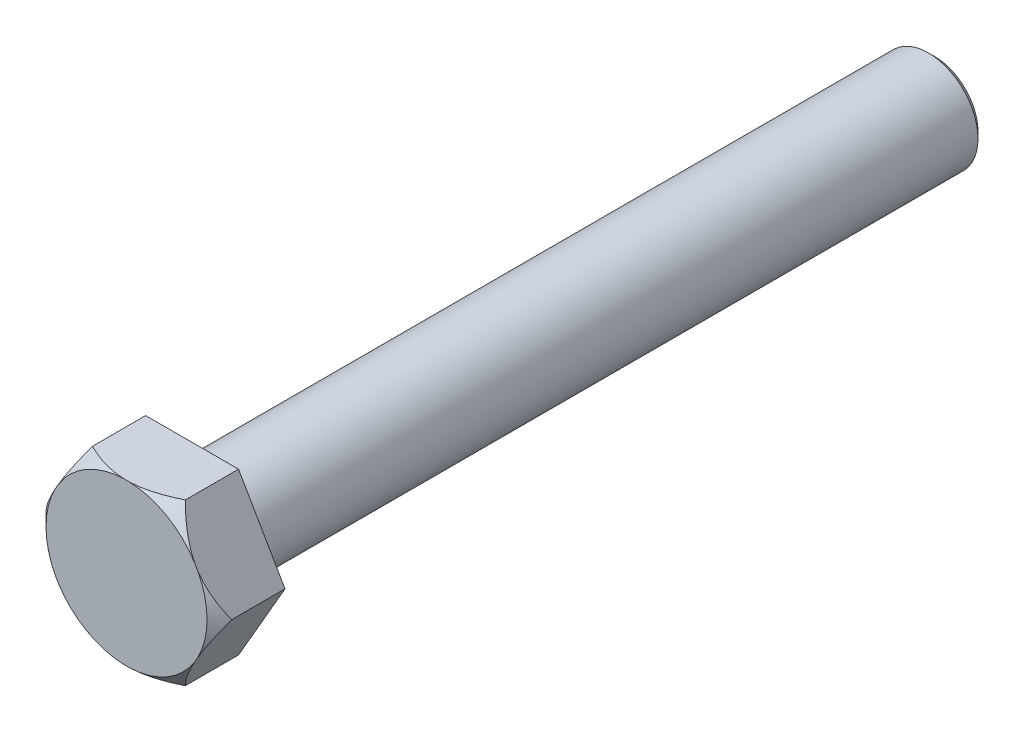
ISO-10303-21;
HEADER;
FILE_DESCRIPTION(('STEP AP214'),'2;1');
FILE_NAME('part.step','',(''),(''),'','','');
FILE_SCHEMA(('AUTOMOTIVE_DESIGN { 1 0 10303 214 1 1 1 1 }'));
ENDSEC;
DATA;
#1=APPLICATION_CONTEXT('core data for automotive mechanical design processes');
#2=APPLICATION_PROTOCOL_DEFINITION('international standard','automotive_design',2000,#1);
#3=PRODUCT_CONTEXT('',#1,'mechanical');
#4=PRODUCT('Part','Part','',(#3));
#5=PRODUCT_RELATED_PRODUCT_CATEGORY('part','',(#4));
#6=PRODUCT_DEFINITION_FORMATION('','',#4);
#7=PRODUCT_DEFINITION_CONTEXT('part definition',#1,'design');
#8=PRODUCT_DEFINITION('design','',#6,#7);
#9=PRODUCT_DEFINITION_SHAPE('','',#8);
#10=(LENGTH_UNIT() NAMED_UNIT(*) SI_UNIT(.MILLI.,.METRE.));
#11=(NAMED_UNIT(*) PLANE_ANGLE_UNIT() SI_UNIT($,.RADIAN.));
#12=(NAMED_UNIT(*) SI_UNIT($,.STERADIAN.) SOLID_ANGLE_UNIT());
#13=UNCERTAINTY_MEASURE_WITH_UNIT(LENGTH_MEASURE(1.E-05),#10,'distance_accuracy_value','');
#14=(GEOMETRIC_REPRESENTATION_CONTEXT(3) GLOBAL_UNCERTAINTY_ASSIGNED_CONTEXT((#13)) GLOBAL_UNIT_ASSIGNED_CONTEXT((#10,
#11,#12)) REPRESENTATION_CONTEXT('',''));
#15=CARTESIAN_POINT('',(0.,0.,0.));
#16=DIRECTION('',(0.,0.,1.));
#17=DIRECTION('',(1.,0.,0.));
#18=AXIS2_PLACEMENT_3D('',#15,#16,#17);
#19=CARTESIAN_POINT('',(0.,-4.,0.));
#20=DIRECTION('',(0.,0.,1.));
#21=DIRECTION('',(1.,0.,0.));
#22=AXIS2_PLACEMENT_3D('',#19,#20,#21);
#23=PLANE('',#22);
#24=CARTESIAN_POINT('',(0.,0.,0.));
#25=DIRECTION('',(0.,0.,1.));
#26=DIRECTION('',(1.,0.,0.));
#27=AXIS2_PLACEMENT_3D('',#24,#25,#26);
#28=CIRCLE('',#27,4.);
#29=CARTESIAN_POINT('',(4.,0.,0.));
#30=VERTEX_POINT('',#29);
#31=EDGE_CURVE('E11',#30,#30,#28,.T.);
#32=ORIENTED_EDGE('',*,*,#31,.T.);
#33=EDGE_LOOP('',(#32));
#34=FACE_BOUND('',#33,.T.);
#35=ADVANCED_FACE('F38',(#34),#23,.T.);
#36=CARTESIAN_POINT('',(0.,0.,0.));
#37=DIRECTION('',(0.,0.,1.));
#38=DIRECTION('',(1.,0.,0.));
#39=AXIS2_PLACEMENT_3D('',#36,#37,#38);
#40=CYLINDRICAL_SURFACE('',#39,4.);
#41=CARTESIAN_POINT('',(0.,0.,-59.5));
#42=DIRECTION('',(0.,0.,1.));
#43=DIRECTION('',(1.,0.,0.));
#44=AXIS2_PLACEMENT_3D('',#41,#42,#43);
#45=CIRCLE('',#44,4.);
#46=CARTESIAN_POINT('',(4.,0.,-59.5));
#47=VERTEX_POINT('',#46);
#48=EDGE_CURVE('E44',#47,#47,#45,.T.);
#49=ORIENTED_EDGE('',*,*,#48,.T.);
#50=EDGE_LOOP('',(#49));
#51=FACE_BOUND('',#50,.T.);
#52=ORIENTED_EDGE('',*,*,#31,.F.);
#53=EDGE_LOOP('',(#52));
#54=FACE_BOUND('',#53,.T.);
#55=ADVANCED_FACE('F64',(#51,#54),#40,.T.);
#56=CARTESIAN_POINT('',(0.,0.,-59.5));
#57=DIRECTION('',(0.,0.,1.));
#58=DIRECTION('',(1.,0.,0.));
#59=AXIS2_PLACEMENT_3D('',#56,#57,#58);
#60=CONICAL_SURFACE('',#59,4.,0.785398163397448);
#61=CARTESIAN_POINT('',(0.,0.,-60.));
#62=DIRECTION('',(0.,0.,1.));
#63=DIRECTION('',(1.,0.,0.));
#64=AXIS2_PLACEMENT_3D('',#61,#62,#63);
#65=CIRCLE('',#64,3.5);
#66=CARTESIAN_POINT('',(3.5,0.,-60.));
#67=VERTEX_POINT('',#66);
#68=EDGE_CURVE('E48',#67,#67,#65,.T.);
#69=ORIENTED_EDGE('',*,*,#68,.T.);
#70=EDGE_LOOP('',(#69));
#71=FACE_BOUND('',#70,.T.);
#72=ORIENTED_EDGE('',*,*,#48,.F.);
#73=EDGE_LOOP('',(#72));
#74=FACE_BOUND('',#73,.T.);
#75=ADVANCED_FACE('F55',(#71,#74),#60,.T.);
#76=CARTESIAN_POINT('',(0.,-3.5,-60.));
#77=DIRECTION('',(0.,0.,-1.));
#78=DIRECTION('',(-1.,0.,0.));
#79=AXIS2_PLACEMENT_3D('',#76,#77,#78);
#80=PLANE('',#79);
#81=ORIENTED_EDGE('',*,*,#68,.F.);
#82=EDGE_LOOP('',(#81));
#83=FACE_BOUND('',#82,.T.);
#84=ADVANCED_FACE('F58',(#83),#80,.T.);
#85=CLOSED_SHELL('',(#35,#55,#75,#84));
#86=MANIFOLD_SOLID_BREP('B2',#85);
#87=CARTESIAN_POINT('',(3.75277674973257,-6.5,5.3));
#88=DIRECTION('',(-0.866025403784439,0.5,0.));
#89=DIRECTION('',(-0.5,-0.866025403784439,0.));
#90=AXIS2_PLACEMENT_3D('',#87,#88,#89);
#91=PLANE('',#90);
#92=DIRECTION('',(0.,0.,-1.));
#93=VECTOR('',#92,1.);
#94=CARTESIAN_POINT('',(7.50555349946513,0.,5.3));
#95=LINE('',#94,#93);
#96=CARTESIAN_POINT('',(7.50555349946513,0.,4.3));
#97=VERTEX_POINT('',#96);
#98=CARTESIAN_POINT('',(7.50555349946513,0.,0.));
#99=VERTEX_POINT('',#98);
#100=EDGE_CURVE('E240',#97,#99,#95,.T.);
#101=ORIENTED_EDGE('',*,*,#100,.F.);
#102=CARTESIAN_POINT('',(10.1286443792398,4.54332667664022,0.704596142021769));
#103=CARTESIAN_POINT('',(10.039761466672,4.38937695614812,0.848684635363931));
#104=CARTESIAN_POINT('',(9.95052655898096,4.23481756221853,0.991912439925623));
#105=CARTESIAN_POINT('',(9.77123095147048,3.92426846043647,1.27631743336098));
#106=CARTESIAN_POINT('',(9.68117017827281,3.76827862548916,1.41749443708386));
#107=CARTESIAN_POINT('',(9.49990390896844,3.45431623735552,1.69777201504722));
#108=CARTESIAN_POINT('',(9.40869621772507,3.29633988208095,1.83686692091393));
#109=CARTESIAN_POINT('',(9.2252068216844,2.97852692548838,2.11218789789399));
#110=CARTESIAN_POINT('',(9.13292514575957,2.81869037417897,2.24841404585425));
#111=CARTESIAN_POINT('',(8.94456358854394,2.49243858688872,2.52115169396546));
#112=CARTESIAN_POINT('',(8.84844908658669,2.32596338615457,2.65756778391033));
#113=CARTESIAN_POINT('',(8.65470525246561,1.99038922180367,2.92602381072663));
#114=CARTESIAN_POINT('',(8.5570759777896,1.82129035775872,3.0580639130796));
#115=CARTESIAN_POINT('',(8.36013893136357,1.48018538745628,3.31668899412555));
#116=CARTESIAN_POINT('',(8.26083264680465,1.30818185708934,3.44327848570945));
#117=CARTESIAN_POINT('',(8.0601982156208,0.960672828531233,3.68985078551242));
#118=CARTESIAN_POINT('',(7.95887032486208,0.78516777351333,3.80983442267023));
#119=CARTESIAN_POINT('',(7.75111491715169,0.425324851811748,4.04472132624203));
#120=CARTESIAN_POINT('',(7.64462356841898,0.24087642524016,4.15940026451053));
#121=CARTESIAN_POINT('',(7.42883796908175,-0.132875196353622,4.37785828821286));
#122=CARTESIAN_POINT('',(7.31954332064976,-0.3221790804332,4.48163581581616));
#123=CARTESIAN_POINT('',(7.09850568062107,-0.705027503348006,4.67487713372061));
#124=CARTESIAN_POINT('',(6.98677906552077,-0.898543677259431,4.7644150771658));
#125=CARTESIAN_POINT('',(6.76025349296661,-1.29089747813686,4.92639894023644));
#126=CARTESIAN_POINT('',(6.64545547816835,-1.48973347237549,4.99885003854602));
#127=CARTESIAN_POINT('',(6.43587432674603,-1.85273867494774,5.11072478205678));
#128=CARTESIAN_POINT('',(6.34158660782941,-2.01604979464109,5.15384004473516));
#129=CARTESIAN_POINT('',(6.15157362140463,-2.34516194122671,5.22476075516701));
#130=CARTESIAN_POINT('',(6.0558485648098,-2.51096260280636,5.25256842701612));
#131=CARTESIAN_POINT('',(5.8637126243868,-2.84375181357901,5.29144611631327));
#132=CARTESIAN_POINT('',(5.76730326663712,-3.01073771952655,5.30254587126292));
#133=CARTESIAN_POINT('',(5.5743709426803,-3.34490630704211,5.30749252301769));
#134=CARTESIAN_POINT('',(5.47784797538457,-3.51208899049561,5.30133925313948));
#135=CARTESIAN_POINT('',(5.28569658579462,-3.84490496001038,5.27215863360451));
#136=CARTESIAN_POINT('',(5.19006652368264,-4.01054108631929,5.24917378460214));
#137=CARTESIAN_POINT('',(5.00008490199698,-4.33959890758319,5.18756324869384));
#138=CARTESIAN_POINT('',(4.90573344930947,-4.50302041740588,5.14893626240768));
#139=CARTESIAN_POINT('',(4.71846263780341,-4.82738297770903,5.05763503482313));
#140=CARTESIAN_POINT('',(4.6255484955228,-4.98831499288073,5.00491850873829));
#141=CARTESIAN_POINT('',(4.44167070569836,-5.30680066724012,4.88744691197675));
#142=CARTESIAN_POINT('',(4.35070696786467,-5.46435448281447,4.82269239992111));
#143=CARTESIAN_POINT('',(4.13900239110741,-5.83103756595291,4.65838995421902));
#144=CARTESIAN_POINT('',(4.01908237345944,-6.03874512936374,4.55462806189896));
#145=CARTESIAN_POINT('',(3.78262258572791,-6.4483054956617,4.33258564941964));
#146=CARTESIAN_POINT('',(3.66608473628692,-6.65015497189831,4.21429707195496));
#147=CARTESIAN_POINT('',(3.43582542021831,-7.0489758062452,3.96621331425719));
#148=CARTESIAN_POINT('',(3.3221102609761,-7.2459362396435,3.83639489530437));
#149=CARTESIAN_POINT('',(3.09735084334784,-7.63523097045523,3.56796602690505));
#150=CARTESIAN_POINT('',(2.98630610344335,-7.82756610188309,3.4293571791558));
#151=CARTESIAN_POINT('',(2.76596059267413,-8.20921572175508,3.14452754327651));
#152=CARTESIAN_POINT('',(2.65667036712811,-8.39851194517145,2.99827427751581));
#153=CARTESIAN_POINT('',(2.44001623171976,-8.77376791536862,2.70017211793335));
#154=CARTESIAN_POINT('',(2.33265239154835,-8.95972754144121,2.54832302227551));
#155=CARTESIAN_POINT('',(2.11967159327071,-9.32862110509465,2.24027391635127));
#156=CARTESIAN_POINT('',(2.01405293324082,-9.51155799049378,2.08407859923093));
#157=CARTESIAN_POINT('',(1.80420589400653,-9.87502372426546,1.76801397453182));
#158=CARTESIAN_POINT('',(1.69997748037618,-10.0555526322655,1.60814475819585));
#159=CARTESIAN_POINT('',(1.51776278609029,-10.3711577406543,1.32438976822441));
#160=CARTESIAN_POINT('',(1.43952456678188,-10.5066703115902,1.20114938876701));
#161=CARTESIAN_POINT('',(1.28399947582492,-10.7760476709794,0.953684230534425));
#162=CARTESIAN_POINT('',(1.20670993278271,-10.9099170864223,0.829466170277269));
#163=CARTESIAN_POINT('',(1.12968586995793,-11.0433266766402,0.704596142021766));
#164=B_SPLINE_CURVE_WITH_KNOTS('',3,(#102,#103,#104,#105,#106,#107,#108,#109,#110,#111,#112,
#113,#114,#115,#116,#117,#118,#119,#120,#121,#122,#123,#124,#125,#126,#127,#128,#129,#130,#131,
#132,#133,#134,#135,#136,#137,#138,#139,#140,#141,#142,#143,#144,#145,#146,#147,#148,#149,#150,
#151,#152,#153,#154,#155,#156,#157,#158,#159,#160,#161,#162,#163),.UNSPECIFIED.,.F.,.F.,(4,2,2,
2,2,2,2,2,2,2,2,2,2,2,2,2,2,2,2,2,2,2,2,2,2,2,2,2,2,2,4),(0.,0.686488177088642,1.3730379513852,
2.06120340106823,2.749350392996,3.4564439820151,4.16351080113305,4.8699804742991,
5.57636129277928,6.30179544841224,7.02733312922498,7.74895922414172,8.47036632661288,
9.05013970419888,9.62982882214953,10.2084849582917,10.7871466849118,11.3643522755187,
11.941605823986,12.52061163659,13.0995905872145,13.8829026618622,14.6666511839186,
15.4520168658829,16.2372398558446,17.0261239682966,17.8150365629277,18.6031280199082,
19.3911999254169,19.9887336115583,20.5836377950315),.UNSPECIFIED.);
#165=CARTESIAN_POINT('',(5.76353991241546,-3.01725604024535,5.3));
#166=VERTEX_POINT('',#165);
#167=EDGE_CURVE('E218',#97,#166,#164,.T.);
#168=ORIENTED_EDGE('',*,*,#167,.T.);
#169=DIRECTION('',(0.5,0.866025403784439,0.));
#170=VECTOR('',#169,1.);
#171=CARTESIAN_POINT('',(3.75277674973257,-6.5,5.3));
#172=LINE('',#171,#170);
#173=CARTESIAN_POINT('',(5.49479033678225,-3.48274395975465,5.3));
#174=VERTEX_POINT('',#173);
#175=EDGE_CURVE('E232',#174,#166,#172,.T.);
#176=ORIENTED_EDGE('',*,*,#175,.F.);
#177=CARTESIAN_POINT('',(3.75277674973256,-6.5,4.3));
#178=VERTEX_POINT('',#177);
#179=EDGE_CURVE('E305',#174,#178,#164,.T.);
#180=ORIENTED_EDGE('',*,*,#179,.T.);
#181=DIRECTION('',(0.,0.,-1.));
#182=VECTOR('',#181,1.);
#183=CARTESIAN_POINT('',(3.75277674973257,-6.5,5.3));
#184=LINE('',#183,#182);
#185=CARTESIAN_POINT('',(3.75277674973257,-6.5,0.));
#186=VERTEX_POINT('',#185);
#187=EDGE_CURVE('E213',#178,#186,#184,.T.);
#188=ORIENTED_EDGE('',*,*,#187,.T.);
#189=DIRECTION('',(0.5,0.866025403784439,0.));
#190=VECTOR('',#189,1.);
#191=CARTESIAN_POINT('',(3.75277674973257,-6.5,0.));
#192=LINE('',#191,#190);
#193=EDGE_CURVE('E214',#186,#99,#192,.T.);
#194=ORIENTED_EDGE('',*,*,#193,.T.);
#195=EDGE_LOOP('',(#101,#168,#176,#180,#188,#194));
#196=FACE_BOUND('',#195,.T.);
#197=ADVANCED_FACE('F93',(#196),#91,.F.);
#198=CARTESIAN_POINT('',(7.50555349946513,0.,5.3));
#199=DIRECTION('',(-0.866025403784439,-0.5,0.));
#200=DIRECTION('',(0.5,-0.866025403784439,0.));
#201=AXIS2_PLACEMENT_3D('',#198,#199,#200);
#202=PLANE('',#201);
#203=DIRECTION('',(0.,0.,-1.));
#204=VECTOR('',#203,1.);
#205=CARTESIAN_POINT('',(3.75277674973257,6.5,5.3));
#206=LINE('',#205,#204);
#207=CARTESIAN_POINT('',(3.75277674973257,6.5,4.3));
#208=VERTEX_POINT('',#207);
#209=CARTESIAN_POINT('',(3.75277674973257,6.5,0.));
#210=VERTEX_POINT('',#209);
#211=EDGE_CURVE('E239',#208,#210,#206,.T.);
#212=ORIENTED_EDGE('',*,*,#211,.F.);
#213=CARTESIAN_POINT('',(1.12968586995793,11.0433266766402,0.704596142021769));
#214=CARTESIAN_POINT('',(1.21856878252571,10.8893769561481,0.848684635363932));
#215=CARTESIAN_POINT('',(1.30780369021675,10.7348175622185,0.991912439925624));
#216=CARTESIAN_POINT('',(1.48709929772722,10.4242684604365,1.27631743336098));
#217=CARTESIAN_POINT('',(1.57716007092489,10.2682786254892,1.41749443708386));
#218=CARTESIAN_POINT('',(1.75842634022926,9.95431623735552,1.69777201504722));
#219=CARTESIAN_POINT('',(1.84963403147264,9.79633988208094,1.83686692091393));
#220=CARTESIAN_POINT('',(2.0331234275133,9.47852692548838,2.11218789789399));
#221=CARTESIAN_POINT('',(2.12540510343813,9.31869037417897,2.24841404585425));
#222=CARTESIAN_POINT('',(2.31376666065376,8.99243858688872,2.52115169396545));
#223=CARTESIAN_POINT('',(2.40988116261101,8.82596338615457,2.65756778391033));
#224=CARTESIAN_POINT('',(2.60362499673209,8.49038922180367,2.92602381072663));
#225=CARTESIAN_POINT('',(2.7012542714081,8.32129035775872,3.05806391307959));
#226=CARTESIAN_POINT('',(2.89819131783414,7.98018538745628,3.31668899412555));
#227=CARTESIAN_POINT('',(2.99749760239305,7.80818185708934,3.44327848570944));
#228=CARTESIAN_POINT('',(3.1981320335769,7.46067282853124,3.68985078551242));
#229=CARTESIAN_POINT('',(3.29945992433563,7.28516777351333,3.80983442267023));
#230=CARTESIAN_POINT('',(3.50721533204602,6.92532485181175,4.04472132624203));
#231=CARTESIAN_POINT('',(3.61370668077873,6.74087642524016,4.15940026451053));
#232=CARTESIAN_POINT('',(3.82949228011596,6.36712480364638,4.37785828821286));
#233=CARTESIAN_POINT('',(3.93878692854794,6.1778209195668,4.48163581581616));
#234=CARTESIAN_POINT('',(4.15982456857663,5.794972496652,4.67487713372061));
#235=CARTESIAN_POINT('',(4.27155118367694,5.60145632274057,4.7644150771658));
#236=CARTESIAN_POINT('',(4.49807675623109,5.20910252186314,4.92639894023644));
#237=CARTESIAN_POINT('',(4.61287477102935,5.01026652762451,4.99885003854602));
#238=CARTESIAN_POINT('',(4.82245592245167,4.64726132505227,5.11072478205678));
#239=CARTESIAN_POINT('',(4.91674364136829,4.48395020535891,5.15384004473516));
#240=CARTESIAN_POINT('',(5.10675662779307,4.15483805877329,5.22476075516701));
#241=CARTESIAN_POINT('',(5.20248168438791,3.98903739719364,5.25256842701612));
#242=CARTESIAN_POINT('',(5.3946176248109,3.65624818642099,5.29144611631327));
#243=CARTESIAN_POINT('',(5.49102698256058,3.48926228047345,5.30254587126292));
#244=CARTESIAN_POINT('',(5.6839593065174,3.15509369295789,5.30749252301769));
#245=CARTESIAN_POINT('',(5.78048227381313,2.98791100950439,5.30133925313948));
#246=CARTESIAN_POINT('',(5.97263366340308,2.65509503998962,5.27215863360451));
#247=CARTESIAN_POINT('',(6.06826372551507,2.48945891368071,5.24917378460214));
#248=CARTESIAN_POINT('',(6.25824534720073,2.16040109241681,5.18756324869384));
#249=CARTESIAN_POINT('',(6.35259679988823,1.99697958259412,5.14893626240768));
#250=CARTESIAN_POINT('',(6.5398676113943,1.67261702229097,5.05763503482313));
#251=CARTESIAN_POINT('',(6.6327817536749,1.51168500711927,5.00491850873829));
#252=CARTESIAN_POINT('',(6.81665954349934,1.19319933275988,4.88744691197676));
#253=CARTESIAN_POINT('',(6.90762328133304,1.03564551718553,4.82269239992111));
#254=CARTESIAN_POINT('',(7.1193278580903,0.668962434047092,4.65838995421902));
#255=CARTESIAN_POINT('',(7.23924787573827,0.461254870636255,4.55462806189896));
#256=CARTESIAN_POINT('',(7.4757076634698,0.0516945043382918,4.33258564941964));
#257=CARTESIAN_POINT('',(7.59224551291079,-0.150154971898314,4.21429707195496));
#258=CARTESIAN_POINT('',(7.82250482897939,-0.548975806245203,3.96621331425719));
#259=CARTESIAN_POINT('',(7.93621998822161,-0.7459362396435,3.83639489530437));
#260=CARTESIAN_POINT('',(8.16097940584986,-1.13523097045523,3.56796602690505));
#261=CARTESIAN_POINT('',(8.27202414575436,-1.32756610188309,3.4293571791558));
#262=CARTESIAN_POINT('',(8.49236965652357,-1.70921572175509,3.14452754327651));
#263=CARTESIAN_POINT('',(8.6016598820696,-1.89851194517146,2.99827427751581));
#264=CARTESIAN_POINT('',(8.81831401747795,-2.27376791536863,2.70017211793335));
#265=CARTESIAN_POINT('',(8.92567785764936,-2.45972754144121,2.5483230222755));
#266=CARTESIAN_POINT('',(9.138658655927,-2.82862110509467,2.24027391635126));
#267=CARTESIAN_POINT('',(9.24427731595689,-3.01155799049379,2.08407859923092));
#268=CARTESIAN_POINT('',(9.45412435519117,-3.37502372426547,1.76801397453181));
#269=CARTESIAN_POINT('',(9.55835276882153,-3.55555263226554,1.60814475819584));
#270=CARTESIAN_POINT('',(9.74056746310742,-3.87115774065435,1.3243897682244));
#271=CARTESIAN_POINT('',(9.81880568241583,-4.00667031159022,1.20114938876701));
#272=CARTESIAN_POINT('',(9.97433077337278,-4.27604767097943,0.953684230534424));
#273=CARTESIAN_POINT('',(10.051620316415,-4.40991708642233,0.829466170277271));
#274=CARTESIAN_POINT('',(10.1286443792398,-4.54332667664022,0.704596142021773));
#275=B_SPLINE_CURVE_WITH_KNOTS('',3,(#213,#214,#215,#216,#217,#218,#219,#220,#221,#222,#223,
#224,#225,#226,#227,#228,#229,#230,#231,#232,#233,#234,#235,#236,#237,#238,#239,#240,#241,#242,
#243,#244,#245,#246,#247,#248,#249,#250,#251,#252,#253,#254,#255,#256,#257,#258,#259,#260,#261,
#262,#263,#264,#265,#266,#267,#268,#269,#270,#271,#272,#273,#274),.UNSPECIFIED.,.F.,.F.,(4,2,2,
2,2,2,2,2,2,2,2,2,2,2,2,2,2,2,2,2,2,2,2,2,2,2,2,2,2,2,4),(0.,0.686488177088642,1.37303795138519,
2.06120340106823,2.749350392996,3.4564439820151,4.16351080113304,4.86998047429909,
5.57636129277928,6.30179544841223,7.02733312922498,7.74895922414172,8.47036632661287,
9.05013970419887,9.62982882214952,10.2084849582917,10.7871466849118,11.3643522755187,
11.941605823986,12.52061163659,13.0995905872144,13.8829026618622,14.6666511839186,
15.4520168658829,16.2372398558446,17.0261239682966,17.8150365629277,18.6031280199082,
19.391199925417,19.9887336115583,20.5836377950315),.UNSPECIFIED.);
#276=CARTESIAN_POINT('',(5.49479033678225,3.48274395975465,5.3));
#277=VERTEX_POINT('',#276);
#278=EDGE_CURVE('E268',#208,#277,#275,.T.);
#279=ORIENTED_EDGE('',*,*,#278,.T.);
#280=DIRECTION('',(-0.5,0.866025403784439,0.));
#281=VECTOR('',#280,1.);
#282=CARTESIAN_POINT('',(7.50555349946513,0.,5.3));
#283=LINE('',#282,#281);
#284=CARTESIAN_POINT('',(5.76353991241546,3.01725604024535,5.3));
#285=VERTEX_POINT('',#284);
#286=EDGE_CURVE('E207',#285,#277,#283,.T.);
#287=ORIENTED_EDGE('',*,*,#286,.F.);
#288=EDGE_CURVE('E273',#285,#97,#275,.T.);
#289=ORIENTED_EDGE('',*,*,#288,.T.);
#290=ORIENTED_EDGE('',*,*,#100,.T.);
#291=DIRECTION('',(-0.5,0.866025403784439,0.));
#292=VECTOR('',#291,1.);
#293=CARTESIAN_POINT('',(7.50555349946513,0.,0.));
#294=LINE('',#293,#292);
#295=EDGE_CURVE('E217',#99,#210,#294,.T.);
#296=ORIENTED_EDGE('',*,*,#295,.T.);
#297=EDGE_LOOP('',(#212,#279,#287,#289,#290,#296));
#298=FACE_BOUND('',#297,.T.);
#299=ADVANCED_FACE('F278',(#298),#202,.F.);
#300=CARTESIAN_POINT('',(3.75277674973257,6.5,5.3));
#301=DIRECTION('',(0.,-1.,0.));
#302=DIRECTION('',(1.,0.,0.));
#303=AXIS2_PLACEMENT_3D('',#300,#301,#302);
#304=PLANE('',#303);
#305=DIRECTION('',(0.,0.,-1.));
#306=VECTOR('',#305,1.);
#307=CARTESIAN_POINT('',(-3.75277674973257,6.5,5.3));
#308=LINE('',#307,#306);
#309=CARTESIAN_POINT('',(-3.75277674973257,6.5,4.3));
#310=VERTEX_POINT('',#309);
#311=CARTESIAN_POINT('',(-3.75277674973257,6.5,0.));
#312=VERTEX_POINT('',#311);
#313=EDGE_CURVE('E237',#310,#312,#308,.T.);
#314=ORIENTED_EDGE('',*,*,#313,.F.);
#315=CARTESIAN_POINT('',(-8.29610342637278,6.5,1.26632525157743));
#316=CARTESIAN_POINT('',(-8.11036530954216,6.5,1.41250581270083));
#317=CARTESIAN_POINT('',(-7.92373684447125,6.5,1.55756954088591));
#318=CARTESIAN_POINT('',(-7.54835509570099,6.5,1.84498409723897));
#319=CARTESIAN_POINT('',(-7.35960146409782,6.5,1.98733447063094));
#320=CARTESIAN_POINT('',(-6.97873252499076,6.5,2.2695011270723));
#321=CARTESIAN_POINT('',(-6.7866050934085,6.5,2.40930108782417));
#322=CARTESIAN_POINT('',(-6.39953728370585,6.5,2.68493925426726));
#323=CARTESIAN_POINT('',(-6.20459704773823,6.5,2.82077765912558));
#324=CARTESIAN_POINT('',(-5.80175036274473,6.5,3.09421885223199));
#325=CARTESIAN_POINT('',(-5.59367836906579,6.5,3.231578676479));
#326=CARTESIAN_POINT('',(-5.17329124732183,6.5,3.49972871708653));
#327=CARTESIAN_POINT('',(-4.96097565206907,6.5,3.63051820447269));
#328=CARTESIAN_POINT('',(-4.53185755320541,6.5,3.88357409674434));
#329=CARTESIAN_POINT('',(-4.31506466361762,6.5,4.00585671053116));
#330=CARTESIAN_POINT('',(-3.87593140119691,6.5,4.23995118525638));
#331=CARTESIAN_POINT('',(-3.65359273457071,6.5,4.35176621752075));
#332=CARTESIAN_POINT('',(-3.22593082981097,6.5,4.55126761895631));
#333=CARTESIAN_POINT('',(-3.02121813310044,6.5,4.64025315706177));
#334=CARTESIAN_POINT('',(-2.60646306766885,6.5,4.80502186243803));
#335=CARTESIAN_POINT('',(-2.39642019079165,6.5,4.88080376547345));
#336=CARTESIAN_POINT('',(-1.97356357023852,6.5,5.01546630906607));
#337=CARTESIAN_POINT('',(-1.76080909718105,6.5,5.07453054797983));
#338=CARTESIAN_POINT('',(-1.33093571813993,6.5,5.17398366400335));
#339=CARTESIAN_POINT('',(-1.11381737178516,6.5,5.21437492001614));
#340=CARTESIAN_POINT('',(-0.672554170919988,6.5,5.27457108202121));
#341=CARTESIAN_POINT('',(-0.448353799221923,6.5,5.29397782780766));
#342=CARTESIAN_POINT('',(0.000845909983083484,6.5,5.30942901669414));
#343=CARTESIAN_POINT('',(0.225845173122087,6.5,5.30547558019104));
#344=CARTESIAN_POINT('',(0.67488777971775,6.5,5.27446419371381));
#345=CARTESIAN_POINT('',(0.898926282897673,6.5,5.24733749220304));
#346=CARTESIAN_POINT('',(1.34336613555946,6.5,5.17180698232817));
#347=CARTESIAN_POINT('',(1.56376649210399,6.5,5.12339746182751));
#348=CARTESIAN_POINT('',(2.06628953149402,6.5,4.99055568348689));
#349=CARTESIAN_POINT('',(2.34668289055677,6.5,4.89963518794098));
#350=CARTESIAN_POINT('',(2.89824997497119,6.5,4.69329359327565));
#351=CARTESIAN_POINT('',(3.16941809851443,6.5,4.57785790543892));
#352=CARTESIAN_POINT('',(3.70495151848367,6.5,4.32757146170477));
#353=CARTESIAN_POINT('',(3.96925216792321,6.5,4.19258424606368));
#354=CARTESIAN_POINT('',(4.49001736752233,6.5,3.90855044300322));
#355=CARTESIAN_POINT('',(4.74648371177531,6.5,3.75950710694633));
#356=CARTESIAN_POINT('',(5.2907154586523,6.5,3.42770091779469));
#357=CARTESIAN_POINT('',(5.57743102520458,6.5,3.24322742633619));
#358=CARTESIAN_POINT('',(6.14392762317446,6.5,2.86387292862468));
#359=CARTESIAN_POINT('',(6.42370706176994,6.5,2.66898956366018));
#360=CARTESIAN_POINT('',(6.97140928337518,6.5,2.27586119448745));
#361=CARTESIAN_POINT('',(7.23945723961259,6.5,2.07778986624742));
#362=CARTESIAN_POINT('',(7.63813759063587,6.5,1.77641508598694));
#363=CARTESIAN_POINT('',(7.77042024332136,6.5,1.67528153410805));
#364=CARTESIAN_POINT('',(8.0339850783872,6.5,1.47172940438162));
#365=CARTESIAN_POINT('',(8.16526730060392,6.5,1.36931087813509));
#366=CARTESIAN_POINT('',(8.29610342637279,6.5,1.26632525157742));
#367=B_SPLINE_CURVE_WITH_KNOTS('',3,(#315,#316,#317,#318,#319,#320,#321,#322,#323,#324,#325,
#326,#327,#328,#329,#330,#331,#332,#333,#334,#335,#336,#337,#338,#339,#340,#341,#342,#343,#344,
#345,#346,#347,#348,#349,#350,#351,#352,#353,#354,#355,#356,#357,#358,#359,#360,#361,#362,#363,
#364,#365,#366),.UNSPECIFIED.,.F.,.F.,(4,2,2,2,2,2,2,2,2,2,2,2,2,2,2,2,2,2,2,2,2,2,2,2,2,4),(0.,
0.709097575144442,1.41831297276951,2.13109111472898,2.84383335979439,3.59170118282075,
4.3396517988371,5.0861358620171,5.83239302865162,6.5016733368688,7.17101769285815,
7.83269743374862,8.49429285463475,9.16823229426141,9.84211056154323,10.5179950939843,
11.1940611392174,12.0768086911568,12.9600830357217,13.8498492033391,14.7394100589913,
15.7619006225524,16.7846238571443,17.7843881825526,18.2839221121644,18.7834360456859),.UNSPECIFIED.);
#368=CARTESIAN_POINT('',(-0.26874957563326,6.5,5.3));
#369=VERTEX_POINT('',#368);
#370=EDGE_CURVE('E255',#310,#369,#367,.T.);
#371=ORIENTED_EDGE('',*,*,#370,.T.);
#372=DIRECTION('',(-1.,0.,0.));
#373=VECTOR('',#372,1.);
#374=CARTESIAN_POINT('',(3.75277674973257,6.5,5.3));
#375=LINE('',#374,#373);
#376=CARTESIAN_POINT('',(0.268749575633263,6.5,5.3));
#377=VERTEX_POINT('',#376);
#378=EDGE_CURVE('E203',#377,#369,#375,.T.);
#379=ORIENTED_EDGE('',*,*,#378,.F.);
#380=EDGE_CURVE('E261',#377,#208,#367,.T.);
#381=ORIENTED_EDGE('',*,*,#380,.T.);
#382=ORIENTED_EDGE('',*,*,#211,.T.);
#383=DIRECTION('',(-1.,0.,0.));
#384=VECTOR('',#383,1.);
#385=CARTESIAN_POINT('',(3.75277674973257,6.5,0.));
#386=LINE('',#385,#384);
#387=EDGE_CURVE('E221',#210,#312,#386,.T.);
#388=ORIENTED_EDGE('',*,*,#387,.T.);
#389=EDGE_LOOP('',(#314,#371,#379,#381,#382,#388));
#390=FACE_BOUND('',#389,.T.);
#391=ADVANCED_FACE('F259',(#390),#304,.F.);
#392=CARTESIAN_POINT('',(-3.75277674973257,6.5,5.3));
#393=DIRECTION('',(0.866025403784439,-0.5,0.));
#394=DIRECTION('',(0.5,0.866025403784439,0.));
#395=AXIS2_PLACEMENT_3D('',#392,#393,#394);
#396=PLANE('',#395);
#397=DIRECTION('',(0.,0.,-1.));
#398=VECTOR('',#397,1.);
#399=CARTESIAN_POINT('',(-7.50555349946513,0.,5.3));
#400=LINE('',#399,#398);
#401=CARTESIAN_POINT('',(-7.50555349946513,0.,4.3));
#402=VERTEX_POINT('',#401);
#403=CARTESIAN_POINT('',(-7.50555349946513,0.,0.));
#404=VERTEX_POINT('',#403);
#405=EDGE_CURVE('E195',#402,#404,#400,.T.);
#406=ORIENTED_EDGE('',*,*,#405,.F.);
#407=CARTESIAN_POINT('',(-10.1286443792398,-4.54332667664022,0.704596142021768));
#408=CARTESIAN_POINT('',(-10.039761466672,-4.38937695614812,0.84868463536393));
#409=CARTESIAN_POINT('',(-9.95052655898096,-4.23481756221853,0.991912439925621));
#410=CARTESIAN_POINT('',(-9.77123095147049,-3.92426846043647,1.27631743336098));
#411=CARTESIAN_POINT('',(-9.68117017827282,-3.76827862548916,1.41749443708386));
#412=CARTESIAN_POINT('',(-9.49990390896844,-3.45431623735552,1.69777201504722));
#413=CARTESIAN_POINT('',(-9.40869621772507,-3.29633988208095,1.83686692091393));
#414=CARTESIAN_POINT('',(-9.2252068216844,-2.97852692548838,2.11218789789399));
#415=CARTESIAN_POINT('',(-9.13292514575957,-2.81869037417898,2.24841404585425));
#416=CARTESIAN_POINT('',(-8.94456358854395,-2.49243858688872,2.52115169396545));
#417=CARTESIAN_POINT('',(-8.84844908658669,-2.32596338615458,2.65756778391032));
#418=CARTESIAN_POINT('',(-8.65470525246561,-1.99038922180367,2.92602381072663));
#419=CARTESIAN_POINT('',(-8.55707597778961,-1.82129035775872,3.05806391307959));
#420=CARTESIAN_POINT('',(-8.36013893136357,-1.48018538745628,3.31668899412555));
#421=CARTESIAN_POINT('',(-8.26083264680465,-1.30818185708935,3.44327848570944));
#422=CARTESIAN_POINT('',(-8.0601982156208,-0.96067282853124,3.68985078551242));
#423=CARTESIAN_POINT('',(-7.95887032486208,-0.785167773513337,3.80983442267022));
#424=CARTESIAN_POINT('',(-7.75111491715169,-0.425324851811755,4.04472132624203));
#425=CARTESIAN_POINT('',(-7.64462356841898,-0.240876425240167,4.15940026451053));
#426=CARTESIAN_POINT('',(-7.42883796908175,0.132875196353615,4.37785828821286));
#427=CARTESIAN_POINT('',(-7.31954332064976,0.322179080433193,4.48163581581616));
#428=CARTESIAN_POINT('',(-7.09850568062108,0.705027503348,4.67487713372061));
#429=CARTESIAN_POINT('',(-6.98677906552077,0.898543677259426,4.7644150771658));
#430=CARTESIAN_POINT('',(-6.76025349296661,1.29089747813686,4.92639894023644));
#431=CARTESIAN_POINT('',(-6.64545547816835,1.48973347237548,4.99885003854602));
#432=CARTESIAN_POINT('',(-6.43587432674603,1.85273867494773,5.11072478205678));
#433=CARTESIAN_POINT('',(-6.34158660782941,2.01604979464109,5.15384004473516));
#434=CARTESIAN_POINT('',(-6.15157362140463,2.3451619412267,5.22476075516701));
#435=CARTESIAN_POINT('',(-6.0558485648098,2.51096260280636,5.25256842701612));
#436=CARTESIAN_POINT('',(-5.86371262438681,2.84375181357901,5.29144611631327));
#437=CARTESIAN_POINT('',(-5.76730326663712,3.01073771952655,5.30254587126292));
#438=CARTESIAN_POINT('',(-5.5743709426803,3.3449063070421,5.30749252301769));
#439=CARTESIAN_POINT('',(-5.47784797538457,3.51208899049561,5.30133925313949));
#440=CARTESIAN_POINT('',(-5.28569658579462,3.84490496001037,5.27215863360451));
#441=CARTESIAN_POINT('',(-5.19006652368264,4.01054108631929,5.24917378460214));
#442=CARTESIAN_POINT('',(-5.00008490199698,4.33959890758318,5.18756324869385));
#443=CARTESIAN_POINT('',(-4.90573344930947,4.50302041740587,5.14893626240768));
#444=CARTESIAN_POINT('',(-4.71846263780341,4.82738297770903,5.05763503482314));
#445=CARTESIAN_POINT('',(-4.6255484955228,4.98831499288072,5.00491850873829));
#446=CARTESIAN_POINT('',(-4.44167070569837,5.30680066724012,4.88744691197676));
#447=CARTESIAN_POINT('',(-4.35070696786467,5.46435448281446,4.82269239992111));
#448=CARTESIAN_POINT('',(-4.13900239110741,5.8310375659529,4.65838995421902));
#449=CARTESIAN_POINT('',(-4.01908237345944,6.03874512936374,4.55462806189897));
#450=CARTESIAN_POINT('',(-3.78262258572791,6.4483054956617,4.33258564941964));
#451=CARTESIAN_POINT('',(-3.66608473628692,6.6501549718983,4.21429707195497));
#452=CARTESIAN_POINT('',(-3.43582542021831,7.04897580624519,3.9662133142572));
#453=CARTESIAN_POINT('',(-3.3221102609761,7.24593623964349,3.83639489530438));
#454=CARTESIAN_POINT('',(-3.09735084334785,7.63523097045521,3.56796602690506));
#455=CARTESIAN_POINT('',(-2.98630610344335,7.82756610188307,3.42935717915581));
#456=CARTESIAN_POINT('',(-2.76596059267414,8.20921572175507,3.14452754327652));
#457=CARTESIAN_POINT('',(-2.65667036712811,8.39851194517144,2.99827427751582));
#458=CARTESIAN_POINT('',(-2.44001623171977,8.77376791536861,2.70017211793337));
#459=CARTESIAN_POINT('',(-2.33265239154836,8.95972754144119,2.54832302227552));
#460=CARTESIAN_POINT('',(-2.11967159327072,9.32862110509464,2.24027391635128));
#461=CARTESIAN_POINT('',(-2.01405293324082,9.51155799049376,2.08407859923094));
#462=CARTESIAN_POINT('',(-1.80420589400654,9.87502372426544,1.76801397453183));
#463=CARTESIAN_POINT('',(-1.69997748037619,10.0555526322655,1.60814475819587));
#464=CARTESIAN_POINT('',(-1.51776278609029,10.3711577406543,1.32438976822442));
#465=CARTESIAN_POINT('',(-1.43952456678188,10.5066703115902,1.20114938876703));
#466=CARTESIAN_POINT('',(-1.28399947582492,10.7760476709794,0.953684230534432));
#467=CARTESIAN_POINT('',(-1.20670993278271,10.9099170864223,0.829466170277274));
#468=CARTESIAN_POINT('',(-1.12968586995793,11.0433266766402,0.704596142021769));
#469=B_SPLINE_CURVE_WITH_KNOTS('',3,(#407,#408,#409,#410,#411,#412,#413,#414,#415,#416,#417,
#418,#419,#420,#421,#422,#423,#424,#425,#426,#427,#428,#429,#430,#431,#432,#433,#434,#435,#436,
#437,#438,#439,#440,#441,#442,#443,#444,#445,#446,#447,#448,#449,#450,#451,#452,#453,#454,#455,
#456,#457,#458,#459,#460,#461,#462,#463,#464,#465,#466,#467,#468),.UNSPECIFIED.,.F.,.F.,(4,2,2,
2,2,2,2,2,2,2,2,2,2,2,2,2,2,2,2,2,2,2,2,2,2,2,2,2,2,2,4),(0.,0.686488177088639,1.37303795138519,
2.06120340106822,2.749350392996,3.45644398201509,4.16351080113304,4.86998047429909,
5.57636129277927,6.30179544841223,7.02733312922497,7.74895922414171,8.47036632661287,
9.05013970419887,9.62982882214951,10.2084849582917,10.7871466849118,11.3643522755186,
11.9416058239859,12.52061163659,13.0995905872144,13.8829026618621,14.6666511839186,
15.4520168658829,16.2372398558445,17.0261239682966,17.8150365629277,18.6031280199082,
19.3911999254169,19.9887336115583,20.5836377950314),.UNSPECIFIED.);
#470=CARTESIAN_POINT('',(-5.76353991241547,3.01725604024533,5.3));
#471=VERTEX_POINT('',#470);
#472=EDGE_CURVE('E182',#402,#471,#469,.T.);
#473=ORIENTED_EDGE('',*,*,#472,.T.);
#474=DIRECTION('',(-0.5,-0.866025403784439,0.));
#475=VECTOR('',#474,1.);
#476=CARTESIAN_POINT('',(-3.75277674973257,6.5,5.3));
#477=LINE('',#476,#475);
#478=CARTESIAN_POINT('',(-5.49479033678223,3.48274395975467,5.3));
#479=VERTEX_POINT('',#478);
#480=EDGE_CURVE('E193',#479,#471,#477,.T.);
#481=ORIENTED_EDGE('',*,*,#480,.F.);
#482=EDGE_CURVE('E196',#479,#310,#469,.T.);
#483=ORIENTED_EDGE('',*,*,#482,.T.);
#484=ORIENTED_EDGE('',*,*,#313,.T.);
#485=DIRECTION('',(-0.5,-0.866025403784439,0.));
#486=VECTOR('',#485,1.);
#487=CARTESIAN_POINT('',(-3.75277674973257,6.5,0.));
#488=LINE('',#487,#486);
#489=EDGE_CURVE('E224',#312,#404,#488,.T.);
#490=ORIENTED_EDGE('',*,*,#489,.T.);
#491=EDGE_LOOP('',(#406,#473,#481,#483,#484,#490));
#492=FACE_BOUND('',#491,.T.);
#493=ADVANCED_FACE('F191',(#492),#396,.F.);
#494=CARTESIAN_POINT('',(-7.50555349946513,0.,5.3));
#495=DIRECTION('',(0.866025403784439,0.5,0.));
#496=DIRECTION('',(-0.5,0.866025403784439,0.));
#497=AXIS2_PLACEMENT_3D('',#494,#495,#496);
#498=PLANE('',#497);
#499=DIRECTION('',(0.,0.,-1.));
#500=VECTOR('',#499,1.);
#501=CARTESIAN_POINT('',(-3.75277674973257,-6.5,5.3));
#502=LINE('',#501,#500);
#503=CARTESIAN_POINT('',(-3.75277674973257,-6.5,4.3));
#504=VERTEX_POINT('',#503);
#505=CARTESIAN_POINT('',(-3.75277674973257,-6.5,0.));
#506=VERTEX_POINT('',#505);
#507=EDGE_CURVE('E234',#504,#506,#502,.T.);
#508=ORIENTED_EDGE('',*,*,#507,.F.);
#509=CARTESIAN_POINT('',(-1.12968586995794,-11.0433266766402,0.70459614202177));
#510=CARTESIAN_POINT('',(-1.21856878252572,-10.8893769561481,0.848684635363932));
#511=CARTESIAN_POINT('',(-1.30780369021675,-10.7348175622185,0.991912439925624));
#512=CARTESIAN_POINT('',(-1.48709929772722,-10.4242684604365,1.27631743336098));
#513=CARTESIAN_POINT('',(-1.57716007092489,-10.2682786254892,1.41749443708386));
#514=CARTESIAN_POINT('',(-1.75842634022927,-9.95431623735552,1.69777201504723));
#515=CARTESIAN_POINT('',(-1.84963403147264,-9.79633988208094,1.83686692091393));
#516=CARTESIAN_POINT('',(-2.03312342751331,-9.47852692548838,2.11218789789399));
#517=CARTESIAN_POINT('',(-2.12540510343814,-9.31869037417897,2.24841404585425));
#518=CARTESIAN_POINT('',(-2.31376666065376,-8.99243858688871,2.52115169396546));
#519=CARTESIAN_POINT('',(-2.40988116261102,-8.82596338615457,2.65756778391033));
#520=CARTESIAN_POINT('',(-2.6036249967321,-8.49038922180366,2.92602381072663));
#521=CARTESIAN_POINT('',(-2.70125427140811,-8.32129035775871,3.0580639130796));
#522=CARTESIAN_POINT('',(-2.89819131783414,-7.98018538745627,3.31668899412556));
#523=CARTESIAN_POINT('',(-2.99749760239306,-7.80818185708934,3.44327848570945));
#524=CARTESIAN_POINT('',(-3.19813203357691,-7.46067282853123,3.68985078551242));
#525=CARTESIAN_POINT('',(-3.29945992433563,-7.28516777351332,3.80983442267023));
#526=CARTESIAN_POINT('',(-3.50721533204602,-6.92532485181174,4.04472132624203));
#527=CARTESIAN_POINT('',(-3.61370668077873,-6.74087642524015,4.15940026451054));
#528=CARTESIAN_POINT('',(-3.82949228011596,-6.36712480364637,4.37785828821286));
#529=CARTESIAN_POINT('',(-3.93878692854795,-6.17782091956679,4.48163581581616));
#530=CARTESIAN_POINT('',(-4.15982456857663,-5.79497249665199,4.67487713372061));
#531=CARTESIAN_POINT('',(-4.27155118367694,-5.60145632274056,4.7644150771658));
#532=CARTESIAN_POINT('',(-4.4980767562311,-5.20910252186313,4.92639894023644));
#533=CARTESIAN_POINT('',(-4.61287477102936,-5.0102665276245,4.99885003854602));
#534=CARTESIAN_POINT('',(-4.82245592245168,-4.64726132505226,5.11072478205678));
#535=CARTESIAN_POINT('',(-4.9167436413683,-4.4839502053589,5.15384004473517));
#536=CARTESIAN_POINT('',(-5.10675662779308,-4.15483805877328,5.22476075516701));
#537=CARTESIAN_POINT('',(-5.20248168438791,-3.98903739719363,5.25256842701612));
#538=CARTESIAN_POINT('',(-5.3946176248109,-3.65624818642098,5.29144611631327));
#539=CARTESIAN_POINT('',(-5.49102698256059,-3.48926228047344,5.30254587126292));
#540=CARTESIAN_POINT('',(-5.68395930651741,-3.15509369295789,5.30749252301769));
#541=CARTESIAN_POINT('',(-5.78048227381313,-2.98791100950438,5.30133925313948));
#542=CARTESIAN_POINT('',(-5.97263366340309,-2.65509503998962,5.27215863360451));
#543=CARTESIAN_POINT('',(-6.06826372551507,-2.4894589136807,5.24917378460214));
#544=CARTESIAN_POINT('',(-6.25824534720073,-2.16040109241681,5.18756324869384));
#545=CARTESIAN_POINT('',(-6.35259679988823,-1.99697958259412,5.14893626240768));
#546=CARTESIAN_POINT('',(-6.5398676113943,-1.67261702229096,5.05763503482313));
#547=CARTESIAN_POINT('',(-6.6327817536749,-1.51168500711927,5.00491850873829));
#548=CARTESIAN_POINT('',(-6.81665954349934,-1.19319933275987,4.88744691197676));
#549=CARTESIAN_POINT('',(-6.90762328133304,-1.03564551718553,4.82269239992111));
#550=CARTESIAN_POINT('',(-7.1193278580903,-0.668962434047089,4.65838995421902));
#551=CARTESIAN_POINT('',(-7.23924787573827,-0.461254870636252,4.55462806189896));
#552=CARTESIAN_POINT('',(-7.4757076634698,-0.0516945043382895,4.33258564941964));
#553=CARTESIAN_POINT('',(-7.59224551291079,0.150154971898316,4.21429707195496));
#554=CARTESIAN_POINT('',(-7.82250482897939,0.548975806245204,3.96621331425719));
#555=CARTESIAN_POINT('',(-7.9362199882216,0.745936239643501,3.83639489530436));
#556=CARTESIAN_POINT('',(-8.16097940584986,1.13523097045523,3.56796602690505));
#557=CARTESIAN_POINT('',(-8.27202414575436,1.32756610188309,3.4293571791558));
#558=CARTESIAN_POINT('',(-8.49236965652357,1.70921572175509,3.14452754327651));
#559=CARTESIAN_POINT('',(-8.6016598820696,1.89851194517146,2.99827427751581));
#560=CARTESIAN_POINT('',(-8.81831401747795,2.27376791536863,2.70017211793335));
#561=CARTESIAN_POINT('',(-8.92567785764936,2.45972754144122,2.5483230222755));
#562=CARTESIAN_POINT('',(-9.138658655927,2.82862110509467,2.24027391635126));
#563=CARTESIAN_POINT('',(-9.24427731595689,3.01155799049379,2.08407859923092));
#564=CARTESIAN_POINT('',(-9.45412435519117,3.37502372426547,1.76801397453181));
#565=CARTESIAN_POINT('',(-9.55835276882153,3.55555263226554,1.60814475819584));
#566=CARTESIAN_POINT('',(-9.74056746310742,3.87115774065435,1.3243897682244));
#567=CARTESIAN_POINT('',(-9.81880568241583,4.00667031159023,1.20114938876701));
#568=CARTESIAN_POINT('',(-9.97433077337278,4.27604767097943,0.953684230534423));
#569=CARTESIAN_POINT('',(-10.051620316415,4.40991708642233,0.82946617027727));
#570=CARTESIAN_POINT('',(-10.1286443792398,4.54332667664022,0.704596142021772));
#571=B_SPLINE_CURVE_WITH_KNOTS('',3,(#509,#510,#511,#512,#513,#514,#515,#516,#517,#518,#519,
#520,#521,#522,#523,#524,#525,#526,#527,#528,#529,#530,#531,#532,#533,#534,#535,#536,#537,#538,
#539,#540,#541,#542,#543,#544,#545,#546,#547,#548,#549,#550,#551,#552,#553,#554,#555,#556,#557,
#558,#559,#560,#561,#562,#563,#564,#565,#566,#567,#568,#569,#570),.UNSPECIFIED.,.F.,.F.,(4,2,2,
2,2,2,2,2,2,2,2,2,2,2,2,2,2,2,2,2,2,2,2,2,2,2,2,2,2,2,4),(0.,0.686488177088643,1.3730379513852,
2.06120340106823,2.74935039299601,3.4564439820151,4.16351080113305,4.8699804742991,
5.57636129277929,6.30179544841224,7.02733312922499,7.74895922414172,8.47036632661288,
9.05013970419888,9.62982882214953,10.2084849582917,10.7871466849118,11.3643522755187,
11.941605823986,12.52061163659,13.0995905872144,13.8829026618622,14.6666511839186,
15.4520168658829,16.2372398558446,17.0261239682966,17.8150365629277,18.6031280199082,
19.391199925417,19.9887336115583,20.5836377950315),.UNSPECIFIED.);
#572=CARTESIAN_POINT('',(-5.49479033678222,-3.48274395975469,5.3));
#573=VERTEX_POINT('',#572);
#574=EDGE_CURVE('E298',#504,#573,#571,.T.);
#575=ORIENTED_EDGE('',*,*,#574,.T.);
#576=DIRECTION('',(0.5,-0.866025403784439,0.));
#577=VECTOR('',#576,1.);
#578=CARTESIAN_POINT('',(-7.50555349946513,0.,5.3));
#579=LINE('',#578,#577);
#580=CARTESIAN_POINT('',(-5.76353991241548,-3.01725604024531,5.3));
#581=VERTEX_POINT('',#580);
#582=EDGE_CURVE('E202',#581,#573,#579,.T.);
#583=ORIENTED_EDGE('',*,*,#582,.F.);
#584=EDGE_CURVE('E117',#581,#402,#571,.T.);
#585=ORIENTED_EDGE('',*,*,#584,.T.);
#586=ORIENTED_EDGE('',*,*,#405,.T.);
#587=DIRECTION('',(0.5,-0.866025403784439,0.));
#588=VECTOR('',#587,1.);
#589=CARTESIAN_POINT('',(-7.50555349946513,0.,0.));
#590=LINE('',#589,#588);
#591=EDGE_CURVE('E226',#404,#506,#590,.T.);
#592=ORIENTED_EDGE('',*,*,#591,.T.);
#593=EDGE_LOOP('',(#508,#575,#583,#585,#586,#592));
#594=FACE_BOUND('',#593,.T.);
#595=ADVANCED_FACE('F315',(#594),#498,.F.);
#596=CARTESIAN_POINT('',(-3.75277674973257,-6.5,5.3));
#597=DIRECTION('',(0.,1.,0.));
#598=DIRECTION('',(-1.,0.,0.));
#599=AXIS2_PLACEMENT_3D('',#596,#597,#598);
#600=PLANE('',#599);
#601=ORIENTED_EDGE('',*,*,#187,.F.);
#602=CARTESIAN_POINT('',(8.29610342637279,-6.5,1.26632525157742));
#603=CARTESIAN_POINT('',(8.11036530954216,-6.5,1.41250581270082));
#604=CARTESIAN_POINT('',(7.92373684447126,-6.5,1.55756954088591));
#605=CARTESIAN_POINT('',(7.54835509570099,-6.5,1.84498409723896));
#606=CARTESIAN_POINT('',(7.35960146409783,-6.5,1.98733447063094));
#607=CARTESIAN_POINT('',(6.97873252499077,-6.5,2.2695011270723));
#608=CARTESIAN_POINT('',(6.7866050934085,-6.5,2.40930108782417));
#609=CARTESIAN_POINT('',(6.39953728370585,-6.5,2.68493925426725));
#610=CARTESIAN_POINT('',(6.20459704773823,-6.5,2.82077765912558));
#611=CARTESIAN_POINT('',(5.80175036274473,-6.5,3.09421885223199));
#612=CARTESIAN_POINT('',(5.5936783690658,-6.5,3.23157867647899));
#613=CARTESIAN_POINT('',(5.17329124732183,-6.5,3.49972871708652));
#614=CARTESIAN_POINT('',(4.96097565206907,-6.5,3.63051820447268));
#615=CARTESIAN_POINT('',(4.53185755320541,-6.5,3.88357409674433));
#616=CARTESIAN_POINT('',(4.31506466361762,-6.5,4.00585671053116));
#617=CARTESIAN_POINT('',(3.87593140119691,-6.5,4.23995118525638));
#618=CARTESIAN_POINT('',(3.65359273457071,-6.5,4.35176621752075));
#619=CARTESIAN_POINT('',(3.22593082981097,-6.5,4.55126761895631));
#620=CARTESIAN_POINT('',(3.02121813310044,-6.5,4.64025315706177));
#621=CARTESIAN_POINT('',(2.60646306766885,-6.5,4.80502186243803));
#622=CARTESIAN_POINT('',(2.39642019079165,-6.5,4.88080376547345));
#623=CARTESIAN_POINT('',(1.97356357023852,-6.5,5.01546630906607));
#624=CARTESIAN_POINT('',(1.76080909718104,-6.5,5.07453054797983));
#625=CARTESIAN_POINT('',(1.33093571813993,-6.5,5.17398366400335));
#626=CARTESIAN_POINT('',(1.11381737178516,-6.5,5.21437492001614));
#627=CARTESIAN_POINT('',(0.672554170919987,-6.5,5.27457108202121));
#628=CARTESIAN_POINT('',(0.448353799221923,-6.5,5.29397782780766));
#629=CARTESIAN_POINT('',(-0.000845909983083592,-6.5,5.30942901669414));
#630=CARTESIAN_POINT('',(-0.225845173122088,-6.5,5.30547558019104));
#631=CARTESIAN_POINT('',(-0.674887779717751,-6.5,5.27446419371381));
#632=CARTESIAN_POINT('',(-0.898926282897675,-6.5,5.24733749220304));
#633=CARTESIAN_POINT('',(-1.34336613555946,-6.5,5.17180698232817));
#634=CARTESIAN_POINT('',(-1.56376649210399,-6.5,5.12339746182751));
#635=CARTESIAN_POINT('',(-2.06628953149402,-6.5,4.99055568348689));
#636=CARTESIAN_POINT('',(-2.34668289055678,-6.5,4.89963518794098));
#637=CARTESIAN_POINT('',(-2.8982499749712,-6.5,4.69329359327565));
#638=CARTESIAN_POINT('',(-3.16941809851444,-6.5,4.57785790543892));
#639=CARTESIAN_POINT('',(-3.70495151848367,-6.5,4.32757146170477));
#640=CARTESIAN_POINT('',(-3.96925216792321,-6.5,4.19258424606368));
#641=CARTESIAN_POINT('',(-4.49001736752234,-6.5,3.90855044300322));
#642=CARTESIAN_POINT('',(-4.74648371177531,-6.5,3.75950710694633));
#643=CARTESIAN_POINT('',(-5.2907154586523,-6.5,3.42770091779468));
#644=CARTESIAN_POINT('',(-5.57743102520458,-6.5,3.24322742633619));
#645=CARTESIAN_POINT('',(-6.14392762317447,-6.5,2.86387292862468));
#646=CARTESIAN_POINT('',(-6.42370706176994,-6.5,2.66898956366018));
#647=CARTESIAN_POINT('',(-6.97140928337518,-6.5,2.27586119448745));
#648=CARTESIAN_POINT('',(-7.23945723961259,-6.5,2.07778986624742));
#649=CARTESIAN_POINT('',(-7.63813759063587,-6.5,1.77641508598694));
#650=CARTESIAN_POINT('',(-7.77042024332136,-6.5,1.67528153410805));
#651=CARTESIAN_POINT('',(-8.03398507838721,-6.5,1.47172940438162));
#652=CARTESIAN_POINT('',(-8.16526730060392,-6.5,1.36931087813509));
#653=CARTESIAN_POINT('',(-8.29610342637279,-6.5,1.26632525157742));
#654=B_SPLINE_CURVE_WITH_KNOTS('',3,(#602,#603,#604,#605,#606,#607,#608,#609,#610,#611,#612,
#613,#614,#615,#616,#617,#618,#619,#620,#621,#622,#623,#624,#625,#626,#627,#628,#629,#630,#631,
#632,#633,#634,#635,#636,#637,#638,#639,#640,#641,#642,#643,#644,#645,#646,#647,#648,#649,#650,
#651,#652,#653),.UNSPECIFIED.,.F.,.F.,(4,2,2,2,2,2,2,2,2,2,2,2,2,2,2,2,2,2,2,2,2,2,2,2,2,4),(0.,
0.709097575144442,1.41831297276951,2.13109111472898,2.8438333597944,3.59170118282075,
4.33965179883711,5.0861358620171,5.83239302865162,6.50167333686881,7.17101769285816,
7.83269743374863,8.49429285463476,9.16823229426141,9.84211056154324,10.5179950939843,
11.1940611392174,12.0768086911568,12.9600830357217,13.8498492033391,14.7394100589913,
15.7619006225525,16.7846238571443,17.7843881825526,18.2839221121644,18.7834360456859),.UNSPECIFIED.);
#655=CARTESIAN_POINT('',(0.268749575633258,-6.5,5.3));
#656=VERTEX_POINT('',#655);
#657=EDGE_CURVE('E352',#178,#656,#654,.T.);
#658=ORIENTED_EDGE('',*,*,#657,.T.);
#659=DIRECTION('',(1.,0.,0.));
#660=VECTOR('',#659,1.);
#661=CARTESIAN_POINT('',(-3.75277674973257,-6.5,5.3));
#662=LINE('',#661,#660);
#663=CARTESIAN_POINT('',(-0.268749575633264,-6.5,5.3));
#664=VERTEX_POINT('',#663);
#665=EDGE_CURVE('E205',#664,#656,#662,.T.);
#666=ORIENTED_EDGE('',*,*,#665,.F.);
#667=EDGE_CURVE('E109',#664,#504,#654,.T.);
#668=ORIENTED_EDGE('',*,*,#667,.T.);
#669=ORIENTED_EDGE('',*,*,#507,.T.);
#670=DIRECTION('',(1.,0.,0.));
#671=VECTOR('',#670,1.);
#672=CARTESIAN_POINT('',(-3.75277674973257,-6.5,0.));
#673=LINE('',#672,#671);
#674=EDGE_CURVE('E229',#506,#186,#673,.T.);
#675=ORIENTED_EDGE('',*,*,#674,.T.);
#676=EDGE_LOOP('',(#601,#658,#666,#668,#669,#675));
#677=FACE_BOUND('',#676,.T.);
#678=ADVANCED_FACE('F355',(#677),#600,.F.);
#679=CARTESIAN_POINT('',(7.50555349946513,0.,5.3));
#680=DIRECTION('',(0.,0.,1.));
#681=DIRECTION('',(1.,0.,0.));
#682=AXIS2_PLACEMENT_3D('',#679,#680,#681);
#683=PLANE('',#682);
#684=CARTESIAN_POINT('',(0.,0.,5.3));
#685=DIRECTION('',(0.,0.,1.));
#686=DIRECTION('',(1.,0.,0.));
#687=AXIS2_PLACEMENT_3D('',#684,#685,#686);
#688=CIRCLE('',#687,6.50555349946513);
#689=EDGE_CURVE('E36',#174,#656,#688,.F.);
#690=ORIENTED_EDGE('',*,*,#689,.F.);
#691=ORIENTED_EDGE('',*,*,#175,.T.);
#692=EDGE_CURVE('E97',#285,#166,#688,.F.);
#693=ORIENTED_EDGE('',*,*,#692,.F.);
#694=ORIENTED_EDGE('',*,*,#286,.T.);
#695=EDGE_CURVE('E245',#377,#277,#688,.F.);
#696=ORIENTED_EDGE('',*,*,#695,.F.);
#697=ORIENTED_EDGE('',*,*,#378,.T.);
#698=EDGE_CURVE('E187',#479,#369,#688,.F.);
#699=ORIENTED_EDGE('',*,*,#698,.F.);
#700=ORIENTED_EDGE('',*,*,#480,.T.);
#701=EDGE_CURVE('E179',#581,#471,#688,.F.);
#702=ORIENTED_EDGE('',*,*,#701,.F.);
#703=ORIENTED_EDGE('',*,*,#582,.T.);
#704=EDGE_CURVE('E102',#664,#573,#688,.F.);
#705=ORIENTED_EDGE('',*,*,#704,.F.);
#706=ORIENTED_EDGE('',*,*,#665,.T.);
#707=EDGE_LOOP('',(#690,#691,#693,#694,#696,#697,#699,#700,#702,#703,#705,#706));
#708=FACE_BOUND('',#707,.T.);
#709=ADVANCED_FACE('F200',(#708),#683,.T.);
#710=CARTESIAN_POINT('',(7.50555349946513,0.,0.));
#711=DIRECTION('',(0.,0.,1.));
#712=DIRECTION('',(1.,0.,0.));
#713=AXIS2_PLACEMENT_3D('',#710,#711,#712);
#714=PLANE('',#713);
#715=ORIENTED_EDGE('',*,*,#193,.F.);
#716=ORIENTED_EDGE('',*,*,#674,.F.);
#717=ORIENTED_EDGE('',*,*,#591,.F.);
#718=ORIENTED_EDGE('',*,*,#489,.F.);
#719=ORIENTED_EDGE('',*,*,#387,.F.);
#720=ORIENTED_EDGE('',*,*,#295,.F.);
#721=EDGE_LOOP('',(#715,#716,#717,#718,#719,#720));
#722=FACE_BOUND('',#721,.T.);
#723=ADVANCED_FACE('F285',(#722),#714,.F.);
#724=CARTESIAN_POINT('',(0.,0.,5.3));
#725=DIRECTION('',(0.,0.,-1.));
#726=DIRECTION('',(-1.,0.,0.));
#727=AXIS2_PLACEMENT_3D('',#724,#725,#726);
#728=CONICAL_SURFACE('',#727,6.50555349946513,0.785398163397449);
#729=ORIENTED_EDGE('',*,*,#288,.F.);
#730=ORIENTED_EDGE('',*,*,#692,.T.);
#731=ORIENTED_EDGE('',*,*,#167,.F.);
#732=EDGE_LOOP('',(#729,#730,#731));
#733=FACE_BOUND('',#732,.T.);
#734=ADVANCED_FACE('F280',(#733),#728,.T.);
#735=ORIENTED_EDGE('',*,*,#380,.F.);
#736=ORIENTED_EDGE('',*,*,#695,.T.);
#737=ORIENTED_EDGE('',*,*,#278,.F.);
#738=EDGE_LOOP('',(#735,#736,#737));
#739=FACE_BOUND('',#738,.T.);
#740=ADVANCED_FACE('F284',(#739),#728,.T.);
#741=ORIENTED_EDGE('',*,*,#482,.F.);
#742=ORIENTED_EDGE('',*,*,#698,.T.);
#743=ORIENTED_EDGE('',*,*,#370,.F.);
#744=EDGE_LOOP('',(#741,#742,#743));
#745=FACE_BOUND('',#744,.T.);
#746=ADVANCED_FACE('F254',(#745),#728,.T.);
#747=ORIENTED_EDGE('',*,*,#584,.F.);
#748=ORIENTED_EDGE('',*,*,#701,.T.);
#749=ORIENTED_EDGE('',*,*,#472,.F.);
#750=EDGE_LOOP('',(#747,#748,#749));
#751=FACE_BOUND('',#750,.T.);
#752=ADVANCED_FACE('F181',(#751),#728,.T.);
#753=ORIENTED_EDGE('',*,*,#667,.F.);
#754=ORIENTED_EDGE('',*,*,#704,.T.);
#755=ORIENTED_EDGE('',*,*,#574,.F.);
#756=EDGE_LOOP('',(#753,#754,#755));
#757=FACE_BOUND('',#756,.T.);
#758=ADVANCED_FACE('F286',(#757),#728,.T.);
#759=ORIENTED_EDGE('',*,*,#689,.T.);
#760=ORIENTED_EDGE('',*,*,#657,.F.);
#761=ORIENTED_EDGE('',*,*,#179,.F.);
#762=EDGE_LOOP('',(#759,#760,#761));
#763=FACE_BOUND('',#762,.T.);
#764=ADVANCED_FACE('F343',(#763),#728,.T.);
#765=CLOSED_SHELL('',(#197,#299,#391,#493,#595,#678,#709,#723,#734,#740,#746,#752,#758,#764));
#766=MANIFOLD_SOLID_BREP('B6',#765);
#767=ADVANCED_BREP_SHAPE_REPRESENTATION('',(#18,#86,#766),#14);
#768=SHAPE_DEFINITION_REPRESENTATION(#9,#767);
ENDSEC;
END-ISO-10303-21;
